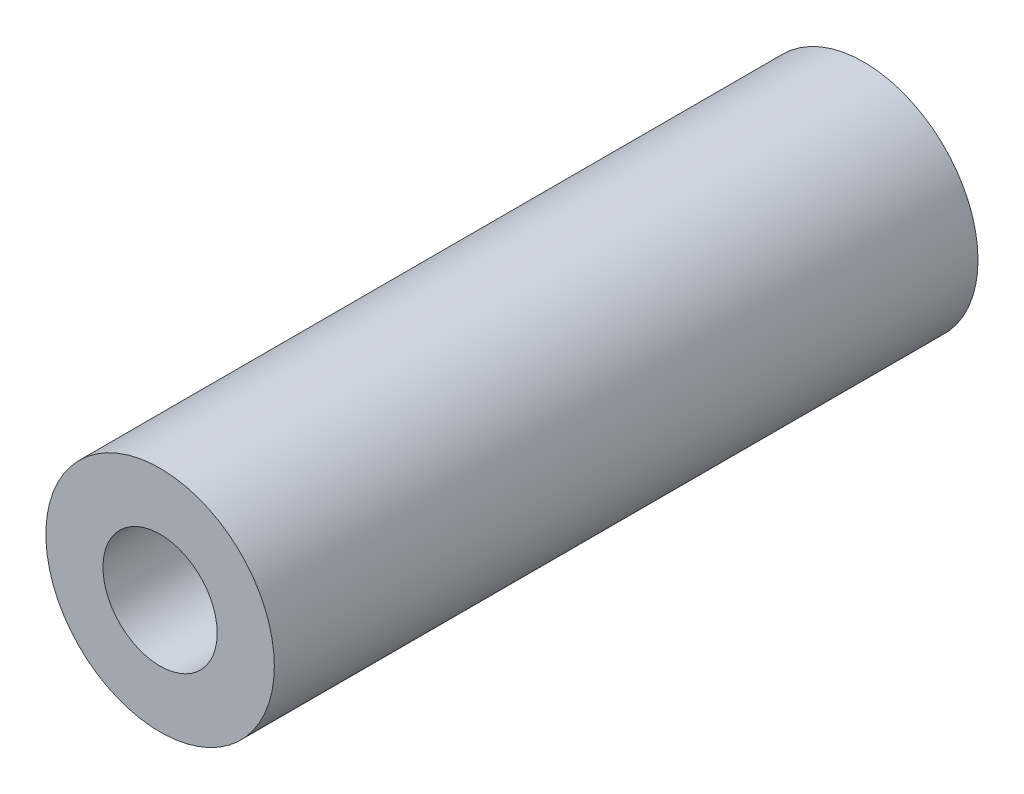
ISO-10303-21;
HEADER;
FILE_DESCRIPTION(('STEP AP214'),'2;1');
FILE_NAME('part.step','',(''),(''),'','','');
FILE_SCHEMA(('AUTOMOTIVE_DESIGN { 1 0 10303 214 1 1 1 1 }'));
ENDSEC;
DATA;
#1=APPLICATION_CONTEXT('core data for automotive mechanical design processes');
#2=APPLICATION_PROTOCOL_DEFINITION('international standard','automotive_design',2000,#1);
#3=PRODUCT_CONTEXT('',#1,'mechanical');
#4=PRODUCT('Part','Part','',(#3));
#5=PRODUCT_RELATED_PRODUCT_CATEGORY('part','',(#4));
#6=PRODUCT_DEFINITION_FORMATION('','',#4);
#7=PRODUCT_DEFINITION_CONTEXT('part definition',#1,'design');
#8=PRODUCT_DEFINITION('design','',#6,#7);
#9=PRODUCT_DEFINITION_SHAPE('','',#8);
#10=(LENGTH_UNIT() NAMED_UNIT(*) SI_UNIT(.MILLI.,.METRE.));
#11=(NAMED_UNIT(*) PLANE_ANGLE_UNIT() SI_UNIT($,.RADIAN.));
#12=(NAMED_UNIT(*) SI_UNIT($,.STERADIAN.) SOLID_ANGLE_UNIT());
#13=UNCERTAINTY_MEASURE_WITH_UNIT(LENGTH_MEASURE(1.E-05),#10,'distance_accuracy_value','');
#14=(GEOMETRIC_REPRESENTATION_CONTEXT(3) GLOBAL_UNCERTAINTY_ASSIGNED_CONTEXT((#13)) GLOBAL_UNIT_ASSIGNED_CONTEXT((#10,
#11,#12)) REPRESENTATION_CONTEXT('',''));
#15=CARTESIAN_POINT('',(0.,0.,0.));
#16=DIRECTION('',(0.,0.,1.));
#17=DIRECTION('',(1.,0.,0.));
#18=AXIS2_PLACEMENT_3D('',#15,#16,#17);
#19=CARTESIAN_POINT('',(0.,0.,38.5000000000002));
#20=DIRECTION('',(0.,0.,1.));
#21=DIRECTION('',(1.,0.,0.));
#22=AXIS2_PLACEMENT_3D('',#19,#20,#21);
#23=PLANE('',#22);
#24=CARTESIAN_POINT('',(0.,0.,38.5000000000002));
#25=DIRECTION('',(0.,0.,1.));
#26=DIRECTION('',(1.,0.,0.));
#27=AXIS2_PLACEMENT_3D('',#24,#25,#26);
#28=CIRCLE('',#27,12.5);
#29=CARTESIAN_POINT('',(12.5,0.,38.5000000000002));
#30=VERTEX_POINT('',#29);
#31=EDGE_CURVE('E12',#30,#30,#28,.T.);
#32=ORIENTED_EDGE('',*,*,#31,.T.);
#33=EDGE_LOOP('',(#32));
#34=FACE_BOUND('',#33,.T.);
#35=CARTESIAN_POINT('',(0.,0.,38.5000000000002));
#36=DIRECTION('',(0.,0.,1.));
#37=DIRECTION('',(1.,0.,0.));
#38=AXIS2_PLACEMENT_3D('',#35,#36,#37);
#39=CIRCLE('',#38,6.25);
#40=CARTESIAN_POINT('',(6.25,0.,38.5000000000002));
#41=VERTEX_POINT('',#40);
#42=EDGE_CURVE('E49',#41,#41,#39,.T.);
#43=ORIENTED_EDGE('',*,*,#42,.F.);
#44=EDGE_LOOP('',(#43));
#45=FACE_BOUND('',#44,.T.);
#46=ADVANCED_FACE('F38',(#34,#45),#23,.T.);
#47=CARTESIAN_POINT('',(-2.08166817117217E-13,1.66533453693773E-13,-38.5));
#48=DIRECTION('',(0.,0.,1.));
#49=DIRECTION('',(1.,0.,0.));
#50=AXIS2_PLACEMENT_3D('',#47,#48,#49);
#51=PLANE('',#50);
#52=CARTESIAN_POINT('',(-2.08166817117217E-13,1.66533453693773E-13,-38.5));
#53=DIRECTION('',(0.,0.,1.));
#54=DIRECTION('',(1.,0.,0.));
#55=AXIS2_PLACEMENT_3D('',#52,#53,#54);
#56=CIRCLE('',#55,12.5);
#57=CARTESIAN_POINT('',(12.4999999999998,1.66359981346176E-13,-38.5));
#58=VERTEX_POINT('',#57);
#59=EDGE_CURVE('E45',#58,#58,#56,.T.);
#60=ORIENTED_EDGE('',*,*,#59,.F.);
#61=EDGE_LOOP('',(#60));
#62=FACE_BOUND('',#61,.T.);
#63=CARTESIAN_POINT('',(-2.08166817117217E-13,1.66533453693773E-13,-38.5));
#64=DIRECTION('',(0.,0.,1.));
#65=DIRECTION('',(1.,0.,0.));
#66=AXIS2_PLACEMENT_3D('',#63,#64,#65);
#67=CIRCLE('',#66,6.25);
#68=CARTESIAN_POINT('',(6.24999999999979,1.66446717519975E-13,-38.5));
#69=VERTEX_POINT('',#68);
#70=EDGE_CURVE('E53',#69,#69,#67,.T.);
#71=ORIENTED_EDGE('',*,*,#70,.T.);
#72=EDGE_LOOP('',(#71));
#73=FACE_BOUND('',#72,.T.);
#74=ADVANCED_FACE('F59',(#62,#73),#51,.F.);
#75=CARTESIAN_POINT('',(0.,0.,38.5000000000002));
#76=DIRECTION('',(0.,0.,-1.));
#77=DIRECTION('',(-1.,0.,0.));
#78=AXIS2_PLACEMENT_3D('',#75,#76,#77);
#79=CYLINDRICAL_SURFACE('',#78,12.5);
#80=ORIENTED_EDGE('',*,*,#31,.F.);
#81=EDGE_LOOP('',(#80));
#82=FACE_BOUND('',#81,.T.);
#83=ORIENTED_EDGE('',*,*,#59,.T.);
#84=EDGE_LOOP('',(#83));
#85=FACE_BOUND('',#84,.T.);
#86=ADVANCED_FACE('F40',(#82,#85),#79,.T.);
#87=CARTESIAN_POINT('',(0.,0.,38.5000000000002));
#88=DIRECTION('',(0.,0.,-1.));
#89=DIRECTION('',(-1.,0.,0.));
#90=AXIS2_PLACEMENT_3D('',#87,#88,#89);
#91=CYLINDRICAL_SURFACE('',#90,6.25);
#92=ORIENTED_EDGE('',*,*,#42,.T.);
#93=EDGE_LOOP('',(#92));
#94=FACE_BOUND('',#93,.T.);
#95=ORIENTED_EDGE('',*,*,#70,.F.);
#96=EDGE_LOOP('',(#95));
#97=FACE_BOUND('',#96,.T.);
#98=ADVANCED_FACE('F61',(#94,#97),#91,.F.);
#99=CLOSED_SHELL('',(#46,#74,#86,#98));
#100=MANIFOLD_SOLID_BREP('B2',#99);
#101=ADVANCED_BREP_SHAPE_REPRESENTATION('',(#18,#100),#14);
#102=SHAPE_DEFINITION_REPRESENTATION(#9,#101);
ENDSEC;
END-ISO-10303-21;
